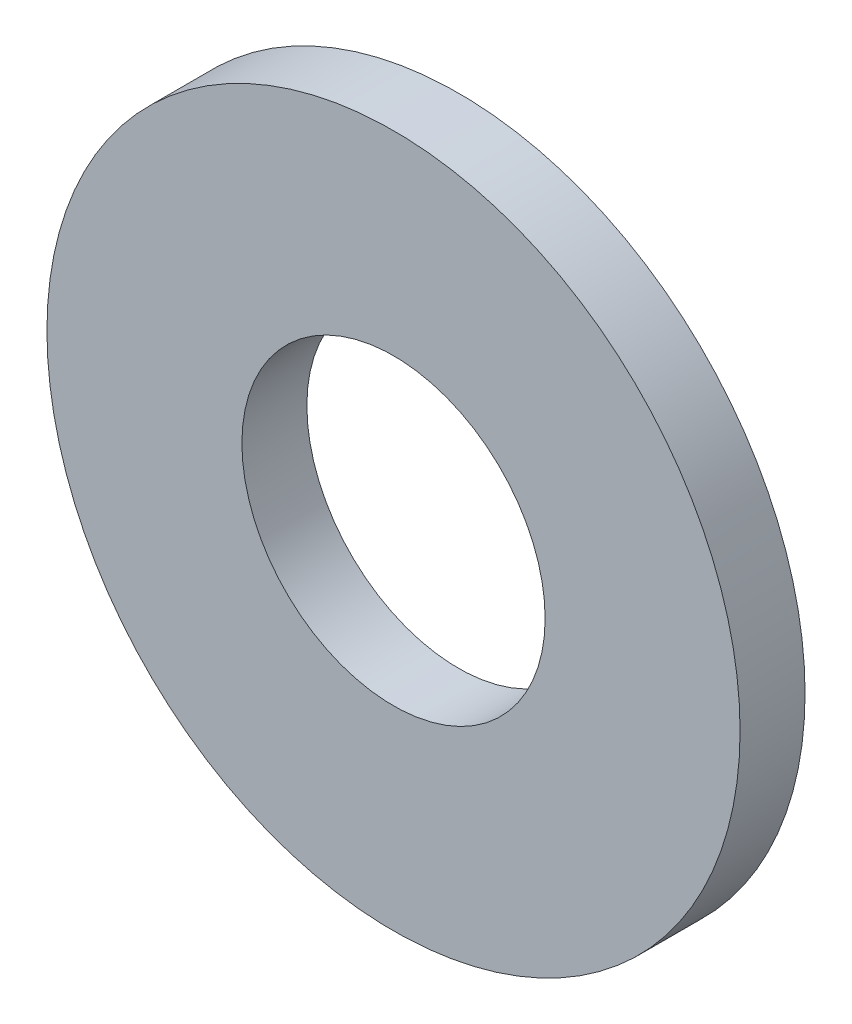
ISO-10303-21;
HEADER;
FILE_DESCRIPTION(('STEP AP214'),'2;1');
FILE_NAME('part.step','',(''),(''),'','','');
FILE_SCHEMA(('AUTOMOTIVE_DESIGN { 1 0 10303 214 1 1 1 1 }'));
ENDSEC;
DATA;
#1=APPLICATION_CONTEXT('core data for automotive mechanical design processes');
#2=APPLICATION_PROTOCOL_DEFINITION('international standard','automotive_design',2000,#1);
#3=PRODUCT_CONTEXT('',#1,'mechanical');
#4=PRODUCT('Part','Part','',(#3));
#5=PRODUCT_RELATED_PRODUCT_CATEGORY('part','',(#4));
#6=PRODUCT_DEFINITION_FORMATION('','',#4);
#7=PRODUCT_DEFINITION_CONTEXT('part definition',#1,'design');
#8=PRODUCT_DEFINITION('design','',#6,#7);
#9=PRODUCT_DEFINITION_SHAPE('','',#8);
#10=(LENGTH_UNIT() NAMED_UNIT(*) SI_UNIT(.MILLI.,.METRE.));
#11=(NAMED_UNIT(*) PLANE_ANGLE_UNIT() SI_UNIT($,.RADIAN.));
#12=(NAMED_UNIT(*) SI_UNIT($,.STERADIAN.) SOLID_ANGLE_UNIT());
#13=UNCERTAINTY_MEASURE_WITH_UNIT(LENGTH_MEASURE(1.E-05),#10,'distance_accuracy_value','');
#14=(GEOMETRIC_REPRESENTATION_CONTEXT(3) GLOBAL_UNCERTAINTY_ASSIGNED_CONTEXT((#13)) GLOBAL_UNIT_ASSIGNED_CONTEXT((#10,
#11,#12)) REPRESENTATION_CONTEXT('',''));
#15=CARTESIAN_POINT('',(0.,0.,0.));
#16=DIRECTION('',(0.,0.,1.));
#17=DIRECTION('',(1.,0.,0.));
#18=AXIS2_PLACEMENT_3D('',#15,#16,#17);
#19=CARTESIAN_POINT('',(0.,0.,1.190625));
#20=DIRECTION('',(0.,0.,1.));
#21=DIRECTION('',(1.,0.,0.));
#22=AXIS2_PLACEMENT_3D('',#19,#20,#21);
#23=PLANE('',#22);
#24=CARTESIAN_POINT('',(0.,0.,1.190625));
#25=DIRECTION('',(0.,0.,1.));
#26=DIRECTION('',(1.,0.,0.));
#27=AXIS2_PLACEMENT_3D('',#24,#25,#26);
#28=CIRCLE('',#27,6.35);
#29=CARTESIAN_POINT('',(-6.35,0.,1.190625));
#30=VERTEX_POINT('',#29);
#31=EDGE_CURVE('E10',#30,#30,#28,.T.);
#32=ORIENTED_EDGE('',*,*,#31,.T.);
#33=EDGE_LOOP('',(#32));
#34=FACE_BOUND('',#33,.T.);
#35=CARTESIAN_POINT('',(0.,0.,1.190625));
#36=DIRECTION('',(0.,0.,1.));
#37=DIRECTION('',(1.,0.,0.));
#38=AXIS2_PLACEMENT_3D('',#35,#36,#37);
#39=CIRCLE('',#38,2.778125);
#40=CARTESIAN_POINT('',(-2.778125,0.,1.190625));
#41=VERTEX_POINT('',#40);
#42=EDGE_CURVE('E44',#41,#41,#39,.T.);
#43=ORIENTED_EDGE('',*,*,#42,.F.);
#44=EDGE_LOOP('',(#43));
#45=FACE_BOUND('',#44,.T.);
#46=ADVANCED_FACE('F33',(#34,#45),#23,.T.);
#47=CARTESIAN_POINT('',(0.,0.,0.));
#48=DIRECTION('',(0.,0.,1.));
#49=DIRECTION('',(1.,0.,0.));
#50=AXIS2_PLACEMENT_3D('',#47,#48,#49);
#51=PLANE('',#50);
#52=CARTESIAN_POINT('',(0.,0.,0.));
#53=DIRECTION('',(0.,0.,1.));
#54=DIRECTION('',(1.,0.,0.));
#55=AXIS2_PLACEMENT_3D('',#52,#53,#54);
#56=CIRCLE('',#55,6.35);
#57=CARTESIAN_POINT('',(-6.35,0.,0.));
#58=VERTEX_POINT('',#57);
#59=EDGE_CURVE('E37',#58,#58,#56,.T.);
#60=ORIENTED_EDGE('',*,*,#59,.F.);
#61=EDGE_LOOP('',(#60));
#62=FACE_BOUND('',#61,.T.);
#63=CARTESIAN_POINT('',(0.,0.,0.));
#64=DIRECTION('',(0.,0.,1.));
#65=DIRECTION('',(1.,0.,0.));
#66=AXIS2_PLACEMENT_3D('',#63,#64,#65);
#67=CIRCLE('',#66,2.778125);
#68=CARTESIAN_POINT('',(-2.778125,0.,0.));
#69=VERTEX_POINT('',#68);
#70=EDGE_CURVE('E46',#69,#69,#67,.T.);
#71=ORIENTED_EDGE('',*,*,#70,.T.);
#72=EDGE_LOOP('',(#71));
#73=FACE_BOUND('',#72,.T.);
#74=ADVANCED_FACE('F56',(#62,#73),#51,.F.);
#75=CARTESIAN_POINT('',(0.,0.,1.190625));
#76=DIRECTION('',(0.,0.,-1.));
#77=DIRECTION('',(-1.,0.,0.));
#78=AXIS2_PLACEMENT_3D('',#75,#76,#77);
#79=CYLINDRICAL_SURFACE('',#78,6.35);
#80=CARTESIAN_POINT('',(-6.35,0.,1.190625));
#81=CARTESIAN_POINT('',(-6.35,0.,1.17822265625));
#82=CARTESIAN_POINT('',(-6.35,0.,1.1658203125));
#83=CARTESIAN_POINT('',(-6.35,0.,1.141015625));
#84=CARTESIAN_POINT('',(-6.35,0.,1.12861328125));
#85=CARTESIAN_POINT('',(-6.35,0.,1.10380859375));
#86=CARTESIAN_POINT('',(-6.35,0.,1.09140625));
#87=CARTESIAN_POINT('',(-6.35,0.,1.0666015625));
#88=CARTESIAN_POINT('',(-6.35,0.,1.05419921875));
#89=CARTESIAN_POINT('',(-6.35,0.,1.02939453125));
#90=CARTESIAN_POINT('',(-6.35,0.,1.0169921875));
#91=CARTESIAN_POINT('',(-6.35,0.,0.9921875));
#92=CARTESIAN_POINT('',(-6.35,0.,0.97978515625));
#93=CARTESIAN_POINT('',(-6.35,0.,0.95498046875));
#94=CARTESIAN_POINT('',(-6.35,0.,0.942578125));
#95=CARTESIAN_POINT('',(-6.35,0.,0.9177734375));
#96=CARTESIAN_POINT('',(-6.35,0.,0.90537109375));
#97=CARTESIAN_POINT('',(-6.35,0.,0.88056640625));
#98=CARTESIAN_POINT('',(-6.35,0.,0.8681640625));
#99=CARTESIAN_POINT('',(-6.35,0.,0.843359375));
#100=CARTESIAN_POINT('',(-6.35,0.,0.83095703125));
#101=CARTESIAN_POINT('',(-6.35,0.,0.80615234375));
#102=CARTESIAN_POINT('',(-6.35,0.,0.79375));
#103=CARTESIAN_POINT('',(-6.35,0.,0.7689453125));
#104=CARTESIAN_POINT('',(-6.35,0.,0.75654296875));
#105=CARTESIAN_POINT('',(-6.35,0.,0.73173828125));
#106=CARTESIAN_POINT('',(-6.35,0.,0.7193359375));
#107=CARTESIAN_POINT('',(-6.35,0.,0.69453125));
#108=CARTESIAN_POINT('',(-6.35,0.,0.68212890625));
#109=CARTESIAN_POINT('',(-6.35,0.,0.65732421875));
#110=CARTESIAN_POINT('',(-6.35,0.,0.644921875));
#111=CARTESIAN_POINT('',(-6.35,0.,0.6201171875));
#112=CARTESIAN_POINT('',(-6.35,0.,0.60771484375));
#113=CARTESIAN_POINT('',(-6.35,0.,0.58291015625));
#114=CARTESIAN_POINT('',(-6.35,0.,0.5705078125));
#115=CARTESIAN_POINT('',(-6.35,0.,0.545703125));
#116=CARTESIAN_POINT('',(-6.35,0.,0.53330078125));
#117=CARTESIAN_POINT('',(-6.35,0.,0.50849609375));
#118=CARTESIAN_POINT('',(-6.35,0.,0.49609375));
#119=CARTESIAN_POINT('',(-6.35,0.,0.4712890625));
#120=CARTESIAN_POINT('',(-6.35,0.,0.45888671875));
#121=CARTESIAN_POINT('',(-6.35,0.,0.43408203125));
#122=CARTESIAN_POINT('',(-6.35,0.,0.4216796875));
#123=CARTESIAN_POINT('',(-6.35,0.,0.396875));
#124=CARTESIAN_POINT('',(-6.35,0.,0.38447265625));
#125=CARTESIAN_POINT('',(-6.35,0.,0.35966796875));
#126=CARTESIAN_POINT('',(-6.35,0.,0.347265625));
#127=CARTESIAN_POINT('',(-6.35,0.,0.3224609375));
#128=CARTESIAN_POINT('',(-6.35,0.,0.31005859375));
#129=CARTESIAN_POINT('',(-6.35,0.,0.28525390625));
#130=CARTESIAN_POINT('',(-6.35,0.,0.2728515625));
#131=CARTESIAN_POINT('',(-6.35,0.,0.248046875));
#132=CARTESIAN_POINT('',(-6.35,0.,0.23564453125));
#133=CARTESIAN_POINT('',(-6.35,0.,0.21083984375));
#134=CARTESIAN_POINT('',(-6.35,0.,0.1984375));
#135=CARTESIAN_POINT('',(-6.35,0.,0.1736328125));
#136=CARTESIAN_POINT('',(-6.35,0.,0.16123046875));
#137=CARTESIAN_POINT('',(-6.35,0.,0.13642578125));
#138=CARTESIAN_POINT('',(-6.35,0.,0.1240234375));
#139=CARTESIAN_POINT('',(-6.35,0.,0.0992187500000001));
#140=CARTESIAN_POINT('',(-6.35,0.,0.08681640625));
#141=CARTESIAN_POINT('',(-6.35,0.,0.06201171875));
#142=CARTESIAN_POINT('',(-6.35,0.,0.049609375));
#143=CARTESIAN_POINT('',(-6.35,0.,0.0248046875));
#144=CARTESIAN_POINT('',(-6.35,0.,0.01240234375));
#145=CARTESIAN_POINT('',(-6.35,0.,0.));
#146=B_SPLINE_CURVE_WITH_KNOTS('',3,(#80,#81,#82,#83,#84,#85,#86,#87,#88,#89,#90,#91,#92,#93,
#94,#95,#96,#97,#98,#99,#100,#101,#102,#103,#104,#105,#106,#107,#108,#109,#110,#111,#112,#113,
#114,#115,#116,#117,#118,#119,#120,#121,#122,#123,#124,#125,#126,#127,#128,#129,#130,#131,#132,
#133,#134,#135,#136,#137,#138,#139,#140,#141,#142,#143,#144,#145),.UNSPECIFIED.,.F.,.F.,(4,2,2,
2,2,2,2,2,2,2,2,2,2,2,2,2,2,2,2,2,2,2,2,2,2,2,2,2,2,2,2,2,4),(0.,0.0372070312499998,
0.0744140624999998,0.11162109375,0.148828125,0.18603515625,0.2232421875,0.26044921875,
0.29765625,0.33486328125,0.3720703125,0.40927734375,0.446484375,0.48369140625,0.5208984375,
0.55810546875,0.5953125,0.63251953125,0.6697265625,0.70693359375,0.744140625,0.78134765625,
0.8185546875,0.85576171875,0.89296875,0.93017578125,0.9673828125,1.00458984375,1.041796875,
1.07900390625,1.1162109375,1.15341796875,1.190625),.UNSPECIFIED.);
#147=EDGE_CURVE('BSEAM35',#30,#58,#146,.T.);
#148=ORIENTED_EDGE('',*,*,#31,.F.);
#149=ORIENTED_EDGE('',*,*,#59,.T.);
#150=ORIENTED_EDGE('',*,*,#147,.T.);
#151=ORIENTED_EDGE('',*,*,#147,.F.);
#152=EDGE_LOOP('',(#148,#150,#149,#151));
#153=FACE_BOUND('',#152,.T.);
#154=ADVANCED_FACE('F35',(#153),#79,.T.);
#155=CARTESIAN_POINT('',(0.,0.,1.190625));
#156=DIRECTION('',(0.,0.,-1.));
#157=DIRECTION('',(-1.,0.,0.));
#158=AXIS2_PLACEMENT_3D('',#155,#156,#157);
#159=CYLINDRICAL_SURFACE('',#158,2.778125);
#160=CARTESIAN_POINT('',(-2.778125,0.,1.190625));
#161=CARTESIAN_POINT('',(-2.778125,0.,1.17822265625));
#162=CARTESIAN_POINT('',(-2.778125,0.,1.1658203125));
#163=CARTESIAN_POINT('',(-2.778125,0.,1.141015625));
#164=CARTESIAN_POINT('',(-2.778125,0.,1.12861328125));
#165=CARTESIAN_POINT('',(-2.778125,0.,1.10380859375));
#166=CARTESIAN_POINT('',(-2.778125,0.,1.09140625));
#167=CARTESIAN_POINT('',(-2.778125,0.,1.0666015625));
#168=CARTESIAN_POINT('',(-2.778125,0.,1.05419921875));
#169=CARTESIAN_POINT('',(-2.778125,0.,1.02939453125));
#170=CARTESIAN_POINT('',(-2.778125,0.,1.0169921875));
#171=CARTESIAN_POINT('',(-2.778125,0.,0.9921875));
#172=CARTESIAN_POINT('',(-2.778125,0.,0.97978515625));
#173=CARTESIAN_POINT('',(-2.778125,0.,0.95498046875));
#174=CARTESIAN_POINT('',(-2.778125,0.,0.942578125));
#175=CARTESIAN_POINT('',(-2.778125,0.,0.9177734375));
#176=CARTESIAN_POINT('',(-2.778125,0.,0.90537109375));
#177=CARTESIAN_POINT('',(-2.778125,0.,0.88056640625));
#178=CARTESIAN_POINT('',(-2.778125,0.,0.8681640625));
#179=CARTESIAN_POINT('',(-2.778125,0.,0.843359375));
#180=CARTESIAN_POINT('',(-2.778125,0.,0.83095703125));
#181=CARTESIAN_POINT('',(-2.778125,0.,0.80615234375));
#182=CARTESIAN_POINT('',(-2.778125,0.,0.79375));
#183=CARTESIAN_POINT('',(-2.778125,0.,0.7689453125));
#184=CARTESIAN_POINT('',(-2.778125,0.,0.75654296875));
#185=CARTESIAN_POINT('',(-2.778125,0.,0.73173828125));
#186=CARTESIAN_POINT('',(-2.778125,0.,0.7193359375));
#187=CARTESIAN_POINT('',(-2.778125,0.,0.69453125));
#188=CARTESIAN_POINT('',(-2.778125,0.,0.68212890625));
#189=CARTESIAN_POINT('',(-2.778125,0.,0.65732421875));
#190=CARTESIAN_POINT('',(-2.778125,0.,0.644921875));
#191=CARTESIAN_POINT('',(-2.778125,0.,0.6201171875));
#192=CARTESIAN_POINT('',(-2.778125,0.,0.60771484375));
#193=CARTESIAN_POINT('',(-2.778125,0.,0.58291015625));
#194=CARTESIAN_POINT('',(-2.778125,0.,0.5705078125));
#195=CARTESIAN_POINT('',(-2.778125,0.,0.545703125));
#196=CARTESIAN_POINT('',(-2.778125,0.,0.53330078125));
#197=CARTESIAN_POINT('',(-2.778125,0.,0.50849609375));
#198=CARTESIAN_POINT('',(-2.778125,0.,0.49609375));
#199=CARTESIAN_POINT('',(-2.778125,0.,0.4712890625));
#200=CARTESIAN_POINT('',(-2.778125,0.,0.45888671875));
#201=CARTESIAN_POINT('',(-2.778125,0.,0.43408203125));
#202=CARTESIAN_POINT('',(-2.778125,0.,0.4216796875));
#203=CARTESIAN_POINT('',(-2.778125,0.,0.396875));
#204=CARTESIAN_POINT('',(-2.778125,0.,0.38447265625));
#205=CARTESIAN_POINT('',(-2.778125,0.,0.35966796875));
#206=CARTESIAN_POINT('',(-2.778125,0.,0.347265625));
#207=CARTESIAN_POINT('',(-2.778125,0.,0.3224609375));
#208=CARTESIAN_POINT('',(-2.778125,0.,0.31005859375));
#209=CARTESIAN_POINT('',(-2.778125,0.,0.28525390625));
#210=CARTESIAN_POINT('',(-2.778125,0.,0.2728515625));
#211=CARTESIAN_POINT('',(-2.778125,0.,0.248046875));
#212=CARTESIAN_POINT('',(-2.778125,0.,0.23564453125));
#213=CARTESIAN_POINT('',(-2.778125,0.,0.21083984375));
#214=CARTESIAN_POINT('',(-2.778125,0.,0.1984375));
#215=CARTESIAN_POINT('',(-2.778125,0.,0.1736328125));
#216=CARTESIAN_POINT('',(-2.778125,0.,0.16123046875));
#217=CARTESIAN_POINT('',(-2.778125,0.,0.13642578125));
#218=CARTESIAN_POINT('',(-2.778125,0.,0.1240234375));
#219=CARTESIAN_POINT('',(-2.778125,0.,0.0992187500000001));
#220=CARTESIAN_POINT('',(-2.778125,0.,0.08681640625));
#221=CARTESIAN_POINT('',(-2.778125,0.,0.06201171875));
#222=CARTESIAN_POINT('',(-2.778125,0.,0.049609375));
#223=CARTESIAN_POINT('',(-2.778125,0.,0.0248046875));
#224=CARTESIAN_POINT('',(-2.778125,0.,0.01240234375));
#225=CARTESIAN_POINT('',(-2.778125,0.,0.));
#226=B_SPLINE_CURVE_WITH_KNOTS('',3,(#160,#161,#162,#163,#164,#165,#166,#167,#168,#169,#170,
#171,#172,#173,#174,#175,#176,#177,#178,#179,#180,#181,#182,#183,#184,#185,#186,#187,#188,#189,
#190,#191,#192,#193,#194,#195,#196,#197,#198,#199,#200,#201,#202,#203,#204,#205,#206,#207,#208,
#209,#210,#211,#212,#213,#214,#215,#216,#217,#218,#219,#220,#221,#222,#223,#224,#225),
.UNSPECIFIED.,.F.,.F.,(4,2,2,2,2,2,2,2,2,2,2,2,2,2,2,2,2,2,2,2,2,2,2,2,2,2,2,2,2,2,2,2,4),(0.,
0.0372070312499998,0.0744140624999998,0.11162109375,0.148828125,0.18603515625,0.2232421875,
0.26044921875,0.29765625,0.33486328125,0.3720703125,0.40927734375,0.446484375,0.48369140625,
0.5208984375,0.55810546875,0.5953125,0.63251953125,0.6697265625,0.70693359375,0.744140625,
0.78134765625,0.8185546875,0.85576171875,0.89296875,0.93017578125,0.9673828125,1.00458984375,
1.041796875,1.07900390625,1.1162109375,1.15341796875,1.190625),.UNSPECIFIED.);
#227=EDGE_CURVE('BSEAM52',#41,#69,#226,.T.);
#228=ORIENTED_EDGE('',*,*,#42,.T.);
#229=ORIENTED_EDGE('',*,*,#70,.F.);
#230=ORIENTED_EDGE('',*,*,#227,.T.);
#231=ORIENTED_EDGE('',*,*,#227,.F.);
#232=EDGE_LOOP('',(#228,#230,#229,#231));
#233=FACE_BOUND('',#232,.T.);
#234=ADVANCED_FACE('F52',(#233),#159,.F.);
#235=CLOSED_SHELL('',(#46,#74,#154,#234));
#236=MANIFOLD_SOLID_BREP('B2',#235);
#237=ADVANCED_BREP_SHAPE_REPRESENTATION('',(#18,#236),#14);
#238=SHAPE_DEFINITION_REPRESENTATION(#9,#237);
ENDSEC;
END-ISO-10303-21;
